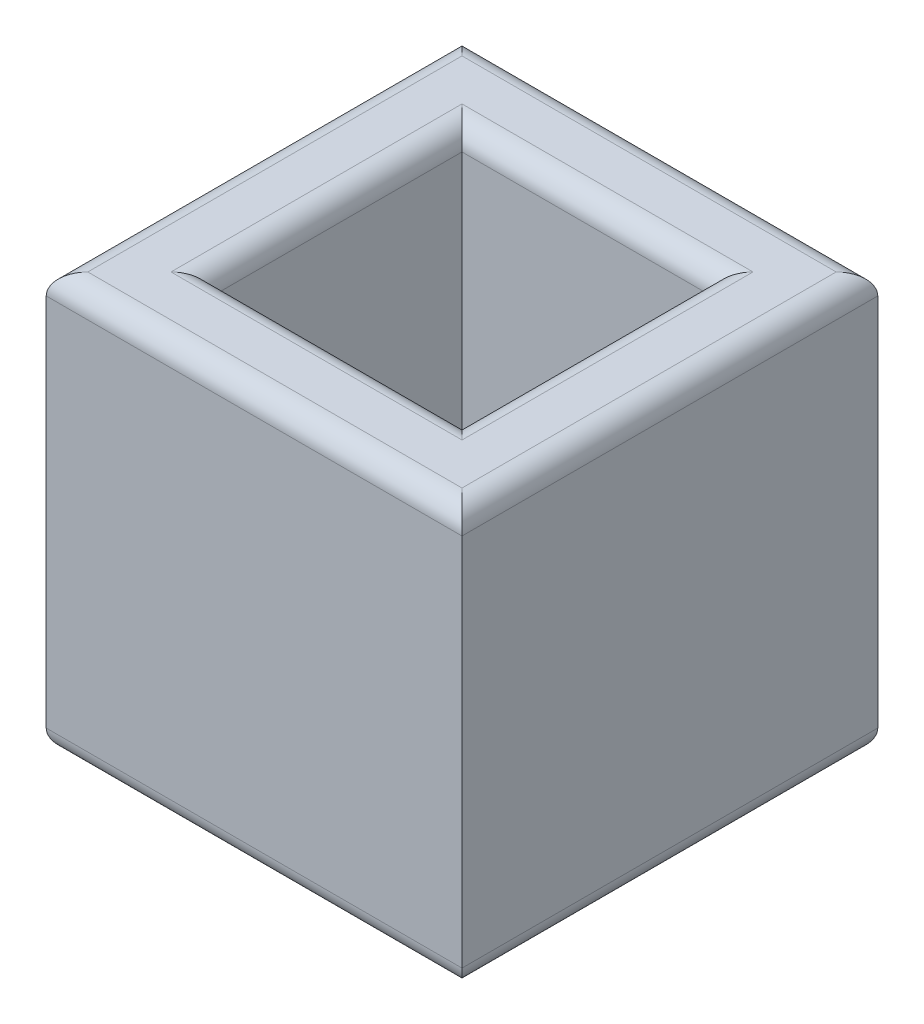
from build123d import *

# Parameters (mm, degrees)
SKETCH1_W           = 127
SKETCH1_H           = 127
BOSS_EXTRUDE1_DEPTH = 127
SKETCH2_W           = 76.2
SKETCH2_H           = 76.2
CUT_EXTRUDE1_DEPTH  = 220.970452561
FILLET1_R           = 6.35


with BuildPart() as part:
    # Sketch1 → Boss-Extrude1 (new body)
    with BuildSketch(Plane(origin=(0, 0, 0), x_dir=(1, 0, 0), z_dir=(0, 1, 0))):
        with Locations((63.5, 63.5)):
            Rectangle(SKETCH1_W, SKETCH1_H)
    extrude(amount=BOSS_EXTRUDE1_DEPTH)

    # Sketch2 → Cut-Extrude1 (cut, through all)
    with BuildSketch(Plane(origin=(0, 127, 0), x_dir=(1, 0, 0), z_dir=(0, 1, 0))):
        with Locations((63.5, 63.5)):
            Rectangle(SKETCH2_W, SKETCH2_H)
    extrude(amount=-CUT_EXTRUDE1_DEPTH, mode=Mode.SUBTRACT)

    # Fillet1
    fillet1_edges = [part.edges().sort_by_distance(p)[0] for p in [
        (127, 127, -63.5),
        (63.5, 127, -127),
        (25.4, 0, -63.5),
        (63.5, 0, -101.6),
        (101.6, 0, -63.5),
        (63.5, 0, -25.4),
        (25.4, 127, -63.5),
        (63.5, 127, -25.4),
        (101.6, 127, -63.5),
        (63.5, 127, -101.6),
        (0, 127, -63.5),
        (63.5, 0, -127),
        (127, 0, -63.5),
        (63.5, 0, 0),
        (0, 0, -63.5),
        (63.5, 127, 0),
    ]]
    fillet(fillet1_edges, radius=FILLET1_R)


solid = part.part
